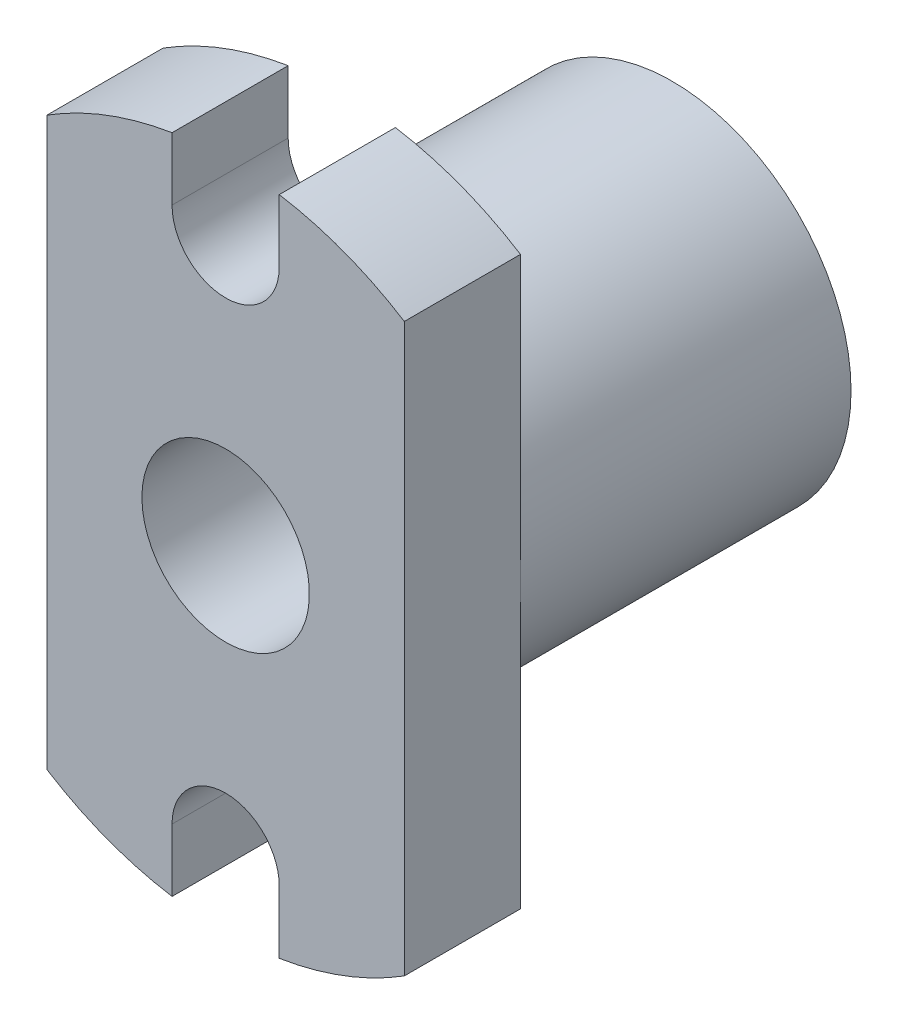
ISO-10303-21;
HEADER;
FILE_DESCRIPTION(('STEP AP214'),'2;1');
FILE_NAME('part.step','',(''),(''),'','','');
FILE_SCHEMA(('AUTOMOTIVE_DESIGN { 1 0 10303 214 1 1 1 1 }'));
ENDSEC;
DATA;
#1=APPLICATION_CONTEXT('core data for automotive mechanical design processes');
#2=APPLICATION_PROTOCOL_DEFINITION('international standard','automotive_design',2000,#1);
#3=PRODUCT_CONTEXT('',#1,'mechanical');
#4=PRODUCT('Part','Part','',(#3));
#5=PRODUCT_RELATED_PRODUCT_CATEGORY('part','',(#4));
#6=PRODUCT_DEFINITION_FORMATION('','',#4);
#7=PRODUCT_DEFINITION_CONTEXT('part definition',#1,'design');
#8=PRODUCT_DEFINITION('design','',#6,#7);
#9=PRODUCT_DEFINITION_SHAPE('','',#8);
#10=(LENGTH_UNIT() NAMED_UNIT(*) SI_UNIT(.MILLI.,.METRE.));
#11=(NAMED_UNIT(*) PLANE_ANGLE_UNIT() SI_UNIT($,.RADIAN.));
#12=(NAMED_UNIT(*) SI_UNIT($,.STERADIAN.) SOLID_ANGLE_UNIT());
#13=UNCERTAINTY_MEASURE_WITH_UNIT(LENGTH_MEASURE(1.E-05),#10,'distance_accuracy_value','');
#14=(GEOMETRIC_REPRESENTATION_CONTEXT(3) GLOBAL_UNCERTAINTY_ASSIGNED_CONTEXT((#13)) GLOBAL_UNIT_ASSIGNED_CONTEXT((#10,
#11,#12)) REPRESENTATION_CONTEXT('',''));
#15=CARTESIAN_POINT('',(0.,0.,0.));
#16=DIRECTION('',(0.,0.,1.));
#17=DIRECTION('',(1.,0.,0.));
#18=AXIS2_PLACEMENT_3D('',#15,#16,#17);
#19=CARTESIAN_POINT('',(0.,0.,12.7));
#20=DIRECTION('',(0.,0.,-1.));
#21=DIRECTION('',(-1.,0.,0.));
#22=AXIS2_PLACEMENT_3D('',#19,#20,#21);
#23=PLANE('',#22);
#24=CARTESIAN_POINT('',(0.,0.,12.7));
#25=DIRECTION('',(0.,0.,-1.));
#26=DIRECTION('',(-1.,0.,0.));
#27=AXIS2_PLACEMENT_3D('',#24,#25,#26);
#28=CIRCLE('',#27,2.38125);
#29=CARTESIAN_POINT('',(-2.38125,0.,12.7));
#30=VERTEX_POINT('',#29);
#31=EDGE_CURVE('E118',#30,#30,#28,.T.);
#32=ORIENTED_EDGE('',*,*,#31,.T.);
#33=EDGE_LOOP('',(#32));
#34=FACE_BOUND('',#33,.T.);
#35=CARTESIAN_POINT('',(0.,0.,12.7));
#36=DIRECTION('',(0.,0.,-1.));
#37=DIRECTION('',(-1.,0.,0.));
#38=AXIS2_PLACEMENT_3D('',#35,#36,#37);
#39=CIRCLE('',#38,9.52499999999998);
#40=CARTESIAN_POINT('',(1.524,9.40228956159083,12.7));
#41=VERTEX_POINT('',#40);
#42=CARTESIAN_POINT('',(5.08,8.05724673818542,12.7));
#43=VERTEX_POINT('',#42);
#44=EDGE_CURVE('E168',#41,#43,#39,.T.);
#45=ORIENTED_EDGE('',*,*,#44,.F.);
#46=DIRECTION('',(0.,1.,0.));
#47=VECTOR('',#46,1.);
#48=CARTESIAN_POINT('',(1.524,9.40228956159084,12.7));
#49=LINE('',#48,#47);
#50=CARTESIAN_POINT('',(1.524,7.62,12.7));
#51=VERTEX_POINT('',#50);
#52=EDGE_CURVE('E190',#51,#41,#49,.T.);
#53=ORIENTED_EDGE('',*,*,#52,.F.);
#54=CARTESIAN_POINT('',(0.,7.62,12.7));
#55=DIRECTION('',(0.,0.,-1.));
#56=DIRECTION('',(-1.,0.,0.));
#57=AXIS2_PLACEMENT_3D('',#54,#55,#56);
#58=CIRCLE('',#57,1.524);
#59=CARTESIAN_POINT('',(-1.524,7.62,12.7));
#60=VERTEX_POINT('',#59);
#61=EDGE_CURVE('E164',#51,#60,#58,.T.);
#62=ORIENTED_EDGE('',*,*,#61,.T.);
#63=DIRECTION('',(0.,1.,0.));
#64=VECTOR('',#63,1.);
#65=CARTESIAN_POINT('',(-1.524,7.62,12.7));
#66=LINE('',#65,#64);
#67=CARTESIAN_POINT('',(-1.524,9.40228956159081,12.7));
#68=VERTEX_POINT('',#67);
#69=EDGE_CURVE('E166',#68,#60,#66,.F.);
#70=ORIENTED_EDGE('',*,*,#69,.F.);
#71=CARTESIAN_POINT('',(0.,0.,12.7));
#72=DIRECTION('',(0.,0.,-1.));
#73=DIRECTION('',(-1.,0.,0.));
#74=AXIS2_PLACEMENT_3D('',#71,#72,#73);
#75=CIRCLE('',#74,9.52499999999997);
#76=CARTESIAN_POINT('',(-5.08,8.05724673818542,12.7));
#77=VERTEX_POINT('',#76);
#78=EDGE_CURVE('E159',#77,#68,#75,.T.);
#79=ORIENTED_EDGE('',*,*,#78,.F.);
#80=DIRECTION('',(0.,1.,0.));
#81=VECTOR('',#80,1.);
#82=CARTESIAN_POINT('',(-5.08,8.05724673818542,12.7));
#83=LINE('',#82,#81);
#84=CARTESIAN_POINT('',(-5.08,-8.05724673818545,12.7));
#85=VERTEX_POINT('',#84);
#86=EDGE_CURVE('E115',#85,#77,#83,.T.);
#87=ORIENTED_EDGE('',*,*,#86,.F.);
#88=CARTESIAN_POINT('',(0.,0.,12.7));
#89=DIRECTION('',(0.,0.,-1.));
#90=DIRECTION('',(-1.,0.,0.));
#91=AXIS2_PLACEMENT_3D('',#88,#89,#90);
#92=CIRCLE('',#91,9.525);
#93=CARTESIAN_POINT('',(-1.52399999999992,-9.40228956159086,12.7));
#94=VERTEX_POINT('',#93);
#95=EDGE_CURVE('E20',#94,#85,#92,.T.);
#96=ORIENTED_EDGE('',*,*,#95,.F.);
#97=DIRECTION('',(0.,1.,0.));
#98=VECTOR('',#97,1.);
#99=CARTESIAN_POINT('',(-1.52399999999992,-9.40228956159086,12.7));
#100=LINE('',#99,#98);
#101=CARTESIAN_POINT('',(-1.52399999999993,-7.62,12.7));
#102=VERTEX_POINT('',#101);
#103=EDGE_CURVE('E112',#102,#94,#100,.F.);
#104=ORIENTED_EDGE('',*,*,#103,.F.);
#105=CARTESIAN_POINT('',(0.,-7.62,12.7));
#106=DIRECTION('',(0.,0.,-1.));
#107=DIRECTION('',(-1.,0.,0.));
#108=AXIS2_PLACEMENT_3D('',#105,#106,#107);
#109=CIRCLE('',#108,1.524);
#110=CARTESIAN_POINT('',(1.52400000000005,-7.61999999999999,12.7));
#111=VERTEX_POINT('',#110);
#112=EDGE_CURVE('E177',#102,#111,#109,.T.);
#113=ORIENTED_EDGE('',*,*,#112,.T.);
#114=DIRECTION('',(0.,1.,0.));
#115=VECTOR('',#114,1.);
#116=CARTESIAN_POINT('',(1.52400000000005,-7.61999999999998,12.7));
#117=LINE('',#116,#115);
#118=CARTESIAN_POINT('',(1.52400000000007,-9.40228956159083,12.7));
#119=VERTEX_POINT('',#118);
#120=EDGE_CURVE('E133',#119,#111,#117,.T.);
#121=ORIENTED_EDGE('',*,*,#120,.F.);
#122=CARTESIAN_POINT('',(0.,0.,12.7));
#123=DIRECTION('',(0.,0.,-1.));
#124=DIRECTION('',(-1.,0.,0.));
#125=AXIS2_PLACEMENT_3D('',#122,#123,#124);
#126=CIRCLE('',#125,9.525);
#127=CARTESIAN_POINT('',(5.08,-8.05724673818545,12.7));
#128=VERTEX_POINT('',#127);
#129=EDGE_CURVE('E173',#128,#119,#126,.T.);
#130=ORIENTED_EDGE('',*,*,#129,.F.);
#131=DIRECTION('',(0.,1.,0.));
#132=VECTOR('',#131,1.);
#133=CARTESIAN_POINT('',(5.08,-8.05724673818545,12.7));
#134=LINE('',#133,#132);
#135=EDGE_CURVE('E193',#43,#128,#134,.F.);
#136=ORIENTED_EDGE('',*,*,#135,.F.);
#137=EDGE_LOOP('',(#45,#53,#62,#70,#79,#87,#96,#104,#113,#121,#130,#136));
#138=FACE_BOUND('',#137,.T.);
#139=ADVANCED_FACE('F16',(#34,#138),#23,.F.);
#140=CARTESIAN_POINT('',(0.,0.,12.7));
#141=DIRECTION('',(0.,0.,-1.));
#142=DIRECTION('',(-1.,0.,0.));
#143=AXIS2_PLACEMENT_3D('',#140,#141,#142);
#144=CYLINDRICAL_SURFACE('',#143,9.525);
#145=ORIENTED_EDGE('',*,*,#95,.T.);
#146=DIRECTION('',(0.,0.,1.));
#147=VECTOR('',#146,1.);
#148=CARTESIAN_POINT('',(-5.08,-8.05724673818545,12.7));
#149=LINE('',#148,#147);
#150=CARTESIAN_POINT('',(-5.08,-8.05724673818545,9.398));
#151=VERTEX_POINT('',#150);
#152=EDGE_CURVE('E184',#151,#85,#149,.T.);
#153=ORIENTED_EDGE('',*,*,#152,.F.);
#154=CARTESIAN_POINT('',(0.,0.,9.398));
#155=DIRECTION('',(0.,0.,-1.));
#156=DIRECTION('',(-1.,0.,0.));
#157=AXIS2_PLACEMENT_3D('',#154,#155,#156);
#158=CIRCLE('',#157,9.525);
#159=CARTESIAN_POINT('',(-1.52399999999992,-9.40228956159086,9.398));
#160=VERTEX_POINT('',#159);
#161=EDGE_CURVE('E123',#151,#160,#158,.F.);
#162=ORIENTED_EDGE('',*,*,#161,.T.);
#163=DIRECTION('',(0.,0.,-1.));
#164=VECTOR('',#163,1.);
#165=CARTESIAN_POINT('',(-1.52399999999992,-9.40228956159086,12.7));
#166=LINE('',#165,#164);
#167=EDGE_CURVE('E120',#94,#160,#166,.T.);
#168=ORIENTED_EDGE('',*,*,#167,.F.);
#169=EDGE_LOOP('',(#145,#153,#162,#168));
#170=FACE_BOUND('',#169,.T.);
#171=ADVANCED_FACE('F121',(#170),#144,.T.);
#172=CARTESIAN_POINT('',(-1.52399999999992,-9.40228956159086,12.7));
#173=DIRECTION('',(1.,0.,0.));
#174=DIRECTION('',(0.,0.,-1.));
#175=AXIS2_PLACEMENT_3D('',#172,#173,#174);
#176=PLANE('',#175);
#177=ORIENTED_EDGE('',*,*,#103,.T.);
#178=ORIENTED_EDGE('',*,*,#167,.T.);
#179=DIRECTION('',(0.,1.,0.));
#180=VECTOR('',#179,1.);
#181=CARTESIAN_POINT('',(-1.52399999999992,0.,9.398));
#182=LINE('',#181,#180);
#183=CARTESIAN_POINT('',(-1.52399999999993,-7.62,9.398));
#184=VERTEX_POINT('',#183);
#185=EDGE_CURVE('E156',#160,#184,#182,.T.);
#186=ORIENTED_EDGE('',*,*,#185,.T.);
#187=DIRECTION('',(0.,0.,-1.));
#188=VECTOR('',#187,1.);
#189=CARTESIAN_POINT('',(-1.52399999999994,-7.62,12.7));
#190=LINE('',#189,#188);
#191=EDGE_CURVE('E126',#184,#102,#190,.F.);
#192=ORIENTED_EDGE('',*,*,#191,.T.);
#193=EDGE_LOOP('',(#177,#178,#186,#192));
#194=FACE_BOUND('',#193,.T.);
#195=ADVANCED_FACE('F128',(#194),#176,.T.);
#196=CARTESIAN_POINT('',(0.,-7.62,12.7));
#197=DIRECTION('',(0.,0.,-1.));
#198=DIRECTION('',(-1.,0.,0.));
#199=AXIS2_PLACEMENT_3D('',#196,#197,#198);
#200=CYLINDRICAL_SURFACE('',#199,1.524);
#201=DIRECTION('',(0.,0.,1.));
#202=VECTOR('',#201,1.);
#203=CARTESIAN_POINT('',(1.52400000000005,-7.61999999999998,12.7));
#204=LINE('',#203,#202);
#205=CARTESIAN_POINT('',(1.52400000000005,-7.61999999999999,9.398));
#206=VERTEX_POINT('',#205);
#207=EDGE_CURVE('E176',#111,#206,#204,.F.);
#208=ORIENTED_EDGE('',*,*,#207,.F.);
#209=ORIENTED_EDGE('',*,*,#112,.F.);
#210=ORIENTED_EDGE('',*,*,#191,.F.);
#211=CARTESIAN_POINT('',(0.,-7.62,9.398));
#212=DIRECTION('',(0.,0.,-1.));
#213=DIRECTION('',(-1.,0.,0.));
#214=AXIS2_PLACEMENT_3D('',#211,#212,#213);
#215=CIRCLE('',#214,1.524);
#216=EDGE_CURVE('E154',#184,#206,#215,.T.);
#217=ORIENTED_EDGE('',*,*,#216,.T.);
#218=EDGE_LOOP('',(#208,#209,#210,#217));
#219=FACE_BOUND('',#218,.T.);
#220=ADVANCED_FACE('F265',(#219),#200,.F.);
#221=CARTESIAN_POINT('',(1.52400000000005,-7.61999999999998,12.7));
#222=DIRECTION('',(-1.,0.,0.));
#223=DIRECTION('',(0.,0.,1.));
#224=AXIS2_PLACEMENT_3D('',#221,#222,#223);
#225=PLANE('',#224);
#226=ORIENTED_EDGE('',*,*,#120,.T.);
#227=ORIENTED_EDGE('',*,*,#207,.T.);
#228=DIRECTION('',(0.,1.,0.));
#229=VECTOR('',#228,1.);
#230=CARTESIAN_POINT('',(1.52400000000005,0.,9.398));
#231=LINE('',#230,#229);
#232=CARTESIAN_POINT('',(1.52400000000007,-9.40228956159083,9.398));
#233=VERTEX_POINT('',#232);
#234=EDGE_CURVE('E153',#206,#233,#231,.F.);
#235=ORIENTED_EDGE('',*,*,#234,.T.);
#236=DIRECTION('',(0.,0.,-1.));
#237=VECTOR('',#236,1.);
#238=CARTESIAN_POINT('',(1.52400000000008,-9.40228956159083,12.7));
#239=LINE('',#238,#237);
#240=EDGE_CURVE('E175',#119,#233,#239,.T.);
#241=ORIENTED_EDGE('',*,*,#240,.F.);
#242=EDGE_LOOP('',(#226,#227,#235,#241));
#243=FACE_BOUND('',#242,.T.);
#244=ADVANCED_FACE('F263',(#243),#225,.T.);
#245=CARTESIAN_POINT('',(0.,0.,12.7));
#246=DIRECTION('',(0.,0.,-1.));
#247=DIRECTION('',(-1.,0.,0.));
#248=AXIS2_PLACEMENT_3D('',#245,#246,#247);
#249=CYLINDRICAL_SURFACE('',#248,9.525);
#250=ORIENTED_EDGE('',*,*,#129,.T.);
#251=ORIENTED_EDGE('',*,*,#240,.T.);
#252=CARTESIAN_POINT('',(0.,0.,9.398));
#253=DIRECTION('',(0.,0.,-1.));
#254=DIRECTION('',(-1.,0.,0.));
#255=AXIS2_PLACEMENT_3D('',#252,#253,#254);
#256=CIRCLE('',#255,9.525);
#257=CARTESIAN_POINT('',(5.08,-8.05724673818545,9.398));
#258=VERTEX_POINT('',#257);
#259=EDGE_CURVE('E150',#233,#258,#256,.F.);
#260=ORIENTED_EDGE('',*,*,#259,.T.);
#261=DIRECTION('',(0.,0.,-1.));
#262=VECTOR('',#261,1.);
#263=CARTESIAN_POINT('',(5.08,-8.05724673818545,12.7));
#264=LINE('',#263,#262);
#265=EDGE_CURVE('E172',#128,#258,#264,.T.);
#266=ORIENTED_EDGE('',*,*,#265,.F.);
#267=EDGE_LOOP('',(#250,#251,#260,#266));
#268=FACE_BOUND('',#267,.T.);
#269=ADVANCED_FACE('F258',(#268),#249,.T.);
#270=CARTESIAN_POINT('',(5.08,-8.05724673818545,12.7));
#271=DIRECTION('',(1.,0.,0.));
#272=DIRECTION('',(0.,0.,-1.));
#273=AXIS2_PLACEMENT_3D('',#270,#271,#272);
#274=PLANE('',#273);
#275=ORIENTED_EDGE('',*,*,#265,.T.);
#276=DIRECTION('',(0.,1.,0.));
#277=VECTOR('',#276,1.);
#278=CARTESIAN_POINT('',(5.08,0.,9.398));
#279=LINE('',#278,#277);
#280=CARTESIAN_POINT('',(5.08,0.,9.398));
#281=VERTEX_POINT('',#280);
#282=EDGE_CURVE('E152',#258,#281,#279,.T.);
#283=ORIENTED_EDGE('',*,*,#282,.T.);
#284=DIRECTION('',(0.,1.,0.));
#285=VECTOR('',#284,1.);
#286=CARTESIAN_POINT('',(5.08,0.,9.398));
#287=LINE('',#286,#285);
#288=CARTESIAN_POINT('',(5.08,8.05724673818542,9.398));
#289=VERTEX_POINT('',#288);
#290=EDGE_CURVE('E149',#281,#289,#287,.T.);
#291=ORIENTED_EDGE('',*,*,#290,.T.);
#292=DIRECTION('',(0.,0.,-1.));
#293=VECTOR('',#292,1.);
#294=CARTESIAN_POINT('',(5.08,8.05724673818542,12.7));
#295=LINE('',#294,#293);
#296=EDGE_CURVE('E171',#43,#289,#295,.T.);
#297=ORIENTED_EDGE('',*,*,#296,.F.);
#298=ORIENTED_EDGE('',*,*,#135,.T.);
#299=EDGE_LOOP('',(#275,#283,#291,#297,#298));
#300=FACE_BOUND('',#299,.T.);
#301=ADVANCED_FACE('F253',(#300),#274,.T.);
#302=CARTESIAN_POINT('',(0.,0.,12.7));
#303=DIRECTION('',(0.,0.,-1.));
#304=DIRECTION('',(-1.,0.,0.));
#305=AXIS2_PLACEMENT_3D('',#302,#303,#304);
#306=CYLINDRICAL_SURFACE('',#305,9.52499999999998);
#307=ORIENTED_EDGE('',*,*,#44,.T.);
#308=ORIENTED_EDGE('',*,*,#296,.T.);
#309=CARTESIAN_POINT('',(0.,0.,9.398));
#310=DIRECTION('',(0.,0.,-1.));
#311=DIRECTION('',(-1.,0.,0.));
#312=AXIS2_PLACEMENT_3D('',#309,#310,#311);
#313=CIRCLE('',#312,9.52499999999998);
#314=CARTESIAN_POINT('',(1.524,9.40228956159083,9.398));
#315=VERTEX_POINT('',#314);
#316=EDGE_CURVE('E147',#289,#315,#313,.F.);
#317=ORIENTED_EDGE('',*,*,#316,.T.);
#318=DIRECTION('',(0.,0.,1.));
#319=VECTOR('',#318,1.);
#320=CARTESIAN_POINT('',(1.524,9.40228956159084,12.7));
#321=LINE('',#320,#319);
#322=EDGE_CURVE('E192',#41,#315,#321,.F.);
#323=ORIENTED_EDGE('',*,*,#322,.F.);
#324=EDGE_LOOP('',(#307,#308,#317,#323));
#325=FACE_BOUND('',#324,.T.);
#326=ADVANCED_FACE('F255',(#325),#306,.T.);
#327=CARTESIAN_POINT('',(1.524,9.40228956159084,12.7));
#328=DIRECTION('',(-1.,0.,0.));
#329=DIRECTION('',(0.,0.,1.));
#330=AXIS2_PLACEMENT_3D('',#327,#328,#329);
#331=PLANE('',#330);
#332=ORIENTED_EDGE('',*,*,#52,.T.);
#333=ORIENTED_EDGE('',*,*,#322,.T.);
#334=DIRECTION('',(0.,1.,0.));
#335=VECTOR('',#334,1.);
#336=CARTESIAN_POINT('',(1.524,0.,9.398));
#337=LINE('',#336,#335);
#338=CARTESIAN_POINT('',(1.524,7.62,9.398));
#339=VERTEX_POINT('',#338);
#340=EDGE_CURVE('E146',#315,#339,#337,.F.);
#341=ORIENTED_EDGE('',*,*,#340,.T.);
#342=DIRECTION('',(0.,0.,-1.));
#343=VECTOR('',#342,1.);
#344=CARTESIAN_POINT('',(1.524,7.62,12.7));
#345=LINE('',#344,#343);
#346=EDGE_CURVE('E167',#339,#51,#345,.F.);
#347=ORIENTED_EDGE('',*,*,#346,.T.);
#348=EDGE_LOOP('',(#332,#333,#341,#347));
#349=FACE_BOUND('',#348,.T.);
#350=ADVANCED_FACE('F283',(#349),#331,.T.);
#351=CARTESIAN_POINT('',(0.,7.62,12.7));
#352=DIRECTION('',(0.,0.,-1.));
#353=DIRECTION('',(-1.,0.,0.));
#354=AXIS2_PLACEMENT_3D('',#351,#352,#353);
#355=CYLINDRICAL_SURFACE('',#354,1.524);
#356=DIRECTION('',(0.,0.,-1.));
#357=VECTOR('',#356,1.);
#358=CARTESIAN_POINT('',(-1.524,7.62,12.7));
#359=LINE('',#358,#357);
#360=CARTESIAN_POINT('',(-1.524,7.62,9.398));
#361=VERTEX_POINT('',#360);
#362=EDGE_CURVE('E163',#60,#361,#359,.T.);
#363=ORIENTED_EDGE('',*,*,#362,.F.);
#364=ORIENTED_EDGE('',*,*,#61,.F.);
#365=ORIENTED_EDGE('',*,*,#346,.F.);
#366=CARTESIAN_POINT('',(0.,7.62,9.398));
#367=DIRECTION('',(0.,0.,-1.));
#368=DIRECTION('',(-1.,0.,0.));
#369=AXIS2_PLACEMENT_3D('',#366,#367,#368);
#370=CIRCLE('',#369,1.524);
#371=EDGE_CURVE('E144',#339,#361,#370,.T.);
#372=ORIENTED_EDGE('',*,*,#371,.T.);
#373=EDGE_LOOP('',(#363,#364,#365,#372));
#374=FACE_BOUND('',#373,.T.);
#375=ADVANCED_FACE('F286',(#374),#355,.F.);
#376=CARTESIAN_POINT('',(-1.524,7.62,12.7));
#377=DIRECTION('',(1.,0.,0.));
#378=DIRECTION('',(0.,0.,-1.));
#379=AXIS2_PLACEMENT_3D('',#376,#377,#378);
#380=PLANE('',#379);
#381=ORIENTED_EDGE('',*,*,#69,.T.);
#382=ORIENTED_EDGE('',*,*,#362,.T.);
#383=DIRECTION('',(0.,1.,0.));
#384=VECTOR('',#383,1.);
#385=CARTESIAN_POINT('',(-1.524,0.,9.398));
#386=LINE('',#385,#384);
#387=CARTESIAN_POINT('',(-1.524,9.40228956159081,9.398));
#388=VERTEX_POINT('',#387);
#389=EDGE_CURVE('E143',#361,#388,#386,.T.);
#390=ORIENTED_EDGE('',*,*,#389,.T.);
#391=DIRECTION('',(0.,0.,-1.));
#392=VECTOR('',#391,1.);
#393=CARTESIAN_POINT('',(-1.524,9.40228956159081,12.7));
#394=LINE('',#393,#392);
#395=EDGE_CURVE('E162',#68,#388,#394,.T.);
#396=ORIENTED_EDGE('',*,*,#395,.F.);
#397=EDGE_LOOP('',(#381,#382,#390,#396));
#398=FACE_BOUND('',#397,.T.);
#399=ADVANCED_FACE('F290',(#398),#380,.T.);
#400=CARTESIAN_POINT('',(0.,0.,12.7));
#401=DIRECTION('',(0.,0.,-1.));
#402=DIRECTION('',(-1.,0.,0.));
#403=AXIS2_PLACEMENT_3D('',#400,#401,#402);
#404=CYLINDRICAL_SURFACE('',#403,9.52499999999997);
#405=ORIENTED_EDGE('',*,*,#78,.T.);
#406=ORIENTED_EDGE('',*,*,#395,.T.);
#407=CARTESIAN_POINT('',(0.,0.,9.398));
#408=DIRECTION('',(0.,0.,-1.));
#409=DIRECTION('',(-1.,0.,0.));
#410=AXIS2_PLACEMENT_3D('',#407,#408,#409);
#411=CIRCLE('',#410,9.52499999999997);
#412=CARTESIAN_POINT('',(-5.08,8.05724673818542,9.398));
#413=VERTEX_POINT('',#412);
#414=EDGE_CURVE('E141',#388,#413,#411,.F.);
#415=ORIENTED_EDGE('',*,*,#414,.T.);
#416=DIRECTION('',(0.,0.,1.));
#417=VECTOR('',#416,1.);
#418=CARTESIAN_POINT('',(-5.08,8.05724673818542,12.7));
#419=LINE('',#418,#417);
#420=EDGE_CURVE('E187',#77,#413,#419,.F.);
#421=ORIENTED_EDGE('',*,*,#420,.F.);
#422=EDGE_LOOP('',(#405,#406,#415,#421));
#423=FACE_BOUND('',#422,.T.);
#424=ADVANCED_FACE('F294',(#423),#404,.T.);
#425=CARTESIAN_POINT('',(-5.08,8.05724673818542,12.7));
#426=DIRECTION('',(-1.,0.,0.));
#427=DIRECTION('',(0.,0.,1.));
#428=AXIS2_PLACEMENT_3D('',#425,#426,#427);
#429=PLANE('',#428);
#430=ORIENTED_EDGE('',*,*,#420,.T.);
#431=DIRECTION('',(0.,1.,0.));
#432=VECTOR('',#431,1.);
#433=CARTESIAN_POINT('',(-5.08,0.,9.398));
#434=LINE('',#433,#432);
#435=CARTESIAN_POINT('',(-5.08,0.,9.398));
#436=VERTEX_POINT('',#435);
#437=EDGE_CURVE('E35',#413,#436,#434,.F.);
#438=ORIENTED_EDGE('',*,*,#437,.T.);
#439=DIRECTION('',(0.,1.,0.));
#440=VECTOR('',#439,1.);
#441=CARTESIAN_POINT('',(-5.08,0.,9.398));
#442=LINE('',#441,#440);
#443=EDGE_CURVE('E158',#436,#151,#442,.F.);
#444=ORIENTED_EDGE('',*,*,#443,.T.);
#445=ORIENTED_EDGE('',*,*,#152,.T.);
#446=ORIENTED_EDGE('',*,*,#86,.T.);
#447=EDGE_LOOP('',(#430,#438,#444,#445,#446));
#448=FACE_BOUND('',#447,.T.);
#449=ADVANCED_FACE('F298',(#448),#429,.T.);
#450=CARTESIAN_POINT('',(0.,0.,9.398));
#451=DIRECTION('',(0.,0.,1.));
#452=DIRECTION('',(1.,0.,0.));
#453=AXIS2_PLACEMENT_3D('',#450,#451,#452);
#454=PLANE('',#453);
#455=ORIENTED_EDGE('',*,*,#282,.F.);
#456=ORIENTED_EDGE('',*,*,#259,.F.);
#457=ORIENTED_EDGE('',*,*,#234,.F.);
#458=ORIENTED_EDGE('',*,*,#216,.F.);
#459=ORIENTED_EDGE('',*,*,#185,.F.);
#460=ORIENTED_EDGE('',*,*,#161,.F.);
#461=ORIENTED_EDGE('',*,*,#443,.F.);
#462=CARTESIAN_POINT('',(0.,0.,9.398));
#463=DIRECTION('',(0.,0.,1.));
#464=DIRECTION('',(1.,0.,0.));
#465=AXIS2_PLACEMENT_3D('',#462,#463,#464);
#466=CIRCLE('',#465,5.08);
#467=EDGE_CURVE('E138',#281,#436,#466,.F.);
#468=ORIENTED_EDGE('',*,*,#467,.F.);
#469=EDGE_LOOP('',(#455,#456,#457,#458,#459,#460,#461,#468));
#470=FACE_BOUND('',#469,.T.);
#471=ADVANCED_FACE('F249',(#470),#454,.F.);
#472=CARTESIAN_POINT('',(0.,0.,9.398));
#473=DIRECTION('',(0.,0.,1.));
#474=DIRECTION('',(1.,0.,0.));
#475=AXIS2_PLACEMENT_3D('',#472,#473,#474);
#476=PLANE('',#475);
#477=ORIENTED_EDGE('',*,*,#437,.F.);
#478=ORIENTED_EDGE('',*,*,#414,.F.);
#479=ORIENTED_EDGE('',*,*,#389,.F.);
#480=ORIENTED_EDGE('',*,*,#371,.F.);
#481=ORIENTED_EDGE('',*,*,#340,.F.);
#482=ORIENTED_EDGE('',*,*,#316,.F.);
#483=ORIENTED_EDGE('',*,*,#290,.F.);
#484=CARTESIAN_POINT('',(0.,0.,9.398));
#485=DIRECTION('',(0.,0.,1.));
#486=DIRECTION('',(1.,0.,0.));
#487=AXIS2_PLACEMENT_3D('',#484,#485,#486);
#488=CIRCLE('',#487,5.08);
#489=EDGE_CURVE('E26',#436,#281,#488,.F.);
#490=ORIENTED_EDGE('',*,*,#489,.F.);
#491=EDGE_LOOP('',(#477,#478,#479,#480,#481,#482,#483,#490));
#492=FACE_BOUND('',#491,.T.);
#493=ADVANCED_FACE('F239',(#492),#476,.F.);
#494=CARTESIAN_POINT('',(0.,0.,0.));
#495=DIRECTION('',(0.,0.,-1.));
#496=DIRECTION('',(-1.,0.,0.));
#497=AXIS2_PLACEMENT_3D('',#494,#495,#496);
#498=PLANE('',#497);
#499=CARTESIAN_POINT('',(0.,0.,0.));
#500=DIRECTION('',(0.,0.,-1.));
#501=DIRECTION('',(-1.,0.,0.));
#502=AXIS2_PLACEMENT_3D('',#499,#500,#501);
#503=CIRCLE('',#502,2.38125);
#504=CARTESIAN_POINT('',(-2.38125,0.,0.));
#505=VERTEX_POINT('',#504);
#506=EDGE_CURVE('E223',#505,#505,#503,.T.);
#507=ORIENTED_EDGE('',*,*,#506,.F.);
#508=EDGE_LOOP('',(#507));
#509=FACE_BOUND('',#508,.T.);
#510=CARTESIAN_POINT('',(0.,0.,0.));
#511=DIRECTION('',(0.,0.,1.));
#512=DIRECTION('',(1.,0.,0.));
#513=AXIS2_PLACEMENT_3D('',#510,#511,#512);
#514=CIRCLE('',#513,5.08);
#515=CARTESIAN_POINT('',(5.08,0.,0.));
#516=VERTEX_POINT('',#515);
#517=EDGE_CURVE('E10',#516,#516,#514,.T.);
#518=ORIENTED_EDGE('',*,*,#517,.F.);
#519=EDGE_LOOP('',(#518));
#520=FACE_BOUND('',#519,.T.);
#521=ADVANCED_FACE('F236',(#509,#520),#498,.T.);
#522=CARTESIAN_POINT('',(0.,0.,0.));
#523=DIRECTION('',(0.,0.,1.));
#524=DIRECTION('',(1.,0.,0.));
#525=AXIS2_PLACEMENT_3D('',#522,#523,#524);
#526=CYLINDRICAL_SURFACE('',#525,5.08);
#527=ORIENTED_EDGE('',*,*,#517,.T.);
#528=EDGE_LOOP('',(#527));
#529=FACE_BOUND('',#528,.T.);
#530=ORIENTED_EDGE('',*,*,#467,.T.);
#531=ORIENTED_EDGE('',*,*,#489,.T.);
#532=EDGE_LOOP('',(#530,#531));
#533=FACE_BOUND('',#532,.T.);
#534=ADVANCED_FACE('F18',(#529,#533),#526,.T.);
#535=CARTESIAN_POINT('',(0.,0.,12.7));
#536=DIRECTION('',(0.,0.,-1.));
#537=DIRECTION('',(-1.,0.,0.));
#538=AXIS2_PLACEMENT_3D('',#535,#536,#537);
#539=CYLINDRICAL_SURFACE('',#538,2.38125);
#540=CARTESIAN_POINT('',(-2.38125,0.,12.7));
#541=CARTESIAN_POINT('',(-2.38125,0.,12.5677083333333));
#542=CARTESIAN_POINT('',(-2.38125,0.,12.4354166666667));
#543=CARTESIAN_POINT('',(-2.38125,0.,12.1708333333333));
#544=CARTESIAN_POINT('',(-2.38125,0.,12.0385416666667));
#545=CARTESIAN_POINT('',(-2.38125,0.,11.7739583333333));
#546=CARTESIAN_POINT('',(-2.38125,0.,11.6416666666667));
#547=CARTESIAN_POINT('',(-2.38125,0.,11.3770833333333));
#548=CARTESIAN_POINT('',(-2.38125,0.,11.2447916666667));
#549=CARTESIAN_POINT('',(-2.38125,0.,10.9802083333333));
#550=CARTESIAN_POINT('',(-2.38125,0.,10.8479166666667));
#551=CARTESIAN_POINT('',(-2.38125,0.,10.5833333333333));
#552=CARTESIAN_POINT('',(-2.38125,0.,10.4510416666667));
#553=CARTESIAN_POINT('',(-2.38125,0.,10.1864583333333));
#554=CARTESIAN_POINT('',(-2.38125,0.,10.0541666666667));
#555=CARTESIAN_POINT('',(-2.38125,0.,9.78958333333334));
#556=CARTESIAN_POINT('',(-2.38125,0.,9.65729166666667));
#557=CARTESIAN_POINT('',(-2.38125,0.,9.39270833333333));
#558=CARTESIAN_POINT('',(-2.38125,0.,9.26041666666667));
#559=CARTESIAN_POINT('',(-2.38125,0.,8.99583333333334));
#560=CARTESIAN_POINT('',(-2.38125,0.,8.86354166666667));
#561=CARTESIAN_POINT('',(-2.38125,0.,8.59895833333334));
#562=CARTESIAN_POINT('',(-2.38125,0.,8.46666666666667));
#563=CARTESIAN_POINT('',(-2.38125,0.,8.20208333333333));
#564=CARTESIAN_POINT('',(-2.38125,0.,8.06979166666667));
#565=CARTESIAN_POINT('',(-2.38125,0.,7.80520833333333));
#566=CARTESIAN_POINT('',(-2.38125,0.,7.67291666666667));
#567=CARTESIAN_POINT('',(-2.38125,0.,7.40833333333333));
#568=CARTESIAN_POINT('',(-2.38125,0.,7.27604166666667));
#569=CARTESIAN_POINT('',(-2.38125,0.,7.01145833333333));
#570=CARTESIAN_POINT('',(-2.38125,0.,6.87916666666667));
#571=CARTESIAN_POINT('',(-2.38125,0.,6.61458333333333));
#572=CARTESIAN_POINT('',(-2.38125,0.,6.48229166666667));
#573=CARTESIAN_POINT('',(-2.38125,0.,6.21770833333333));
#574=CARTESIAN_POINT('',(-2.38125,0.,6.08541666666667));
#575=CARTESIAN_POINT('',(-2.38125,0.,5.82083333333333));
#576=CARTESIAN_POINT('',(-2.38125,0.,5.68854166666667));
#577=CARTESIAN_POINT('',(-2.38125,0.,5.42395833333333));
#578=CARTESIAN_POINT('',(-2.38125,0.,5.29166666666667));
#579=CARTESIAN_POINT('',(-2.38125,0.,5.02708333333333));
#580=CARTESIAN_POINT('',(-2.38125,0.,4.89479166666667));
#581=CARTESIAN_POINT('',(-2.38125,0.,4.63020833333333));
#582=CARTESIAN_POINT('',(-2.38125,0.,4.49791666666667));
#583=CARTESIAN_POINT('',(-2.38125,0.,4.23333333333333));
#584=CARTESIAN_POINT('',(-2.38125,0.,4.10104166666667));
#585=CARTESIAN_POINT('',(-2.38125,0.,3.83645833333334));
#586=CARTESIAN_POINT('',(-2.38125,0.,3.70416666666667));
#587=CARTESIAN_POINT('',(-2.38125,0.,3.43958333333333));
#588=CARTESIAN_POINT('',(-2.38125,0.,3.30729166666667));
#589=CARTESIAN_POINT('',(-2.38125,0.,3.04270833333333));
#590=CARTESIAN_POINT('',(-2.38125,0.,2.91041666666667));
#591=CARTESIAN_POINT('',(-2.38125,0.,2.64583333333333));
#592=CARTESIAN_POINT('',(-2.38125,0.,2.51354166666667));
#593=CARTESIAN_POINT('',(-2.38125,0.,2.24895833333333));
#594=CARTESIAN_POINT('',(-2.38125,0.,2.11666666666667));
#595=CARTESIAN_POINT('',(-2.38125,0.,1.85208333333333));
#596=CARTESIAN_POINT('',(-2.38125,0.,1.71979166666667));
#597=CARTESIAN_POINT('',(-2.38125,0.,1.45520833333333));
#598=CARTESIAN_POINT('',(-2.38125,0.,1.32291666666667));
#599=CARTESIAN_POINT('',(-2.38125,0.,1.05833333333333));
#600=CARTESIAN_POINT('',(-2.38125,0.,0.926041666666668));
#601=CARTESIAN_POINT('',(-2.38125,0.,0.661458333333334));
#602=CARTESIAN_POINT('',(-2.38125,0.,0.529166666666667));
#603=CARTESIAN_POINT('',(-2.38125,0.,0.264583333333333));
#604=CARTESIAN_POINT('',(-2.38125,0.,0.132291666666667));
#605=CARTESIAN_POINT('',(-2.38125,0.,0.));
#606=B_SPLINE_CURVE_WITH_KNOTS('',3,(#540,#541,#542,#543,#544,#545,#546,#547,#548,#549,#550,
#551,#552,#553,#554,#555,#556,#557,#558,#559,#560,#561,#562,#563,#564,#565,#566,#567,#568,#569,
#570,#571,#572,#573,#574,#575,#576,#577,#578,#579,#580,#581,#582,#583,#584,#585,#586,#587,#588,
#589,#590,#591,#592,#593,#594,#595,#596,#597,#598,#599,#600,#601,#602,#603,#604,#605),
.UNSPECIFIED.,.F.,.F.,(4,2,2,2,2,2,2,2,2,2,2,2,2,2,2,2,2,2,2,2,2,2,2,2,2,2,2,2,2,2,2,2,4),(0.,
0.396875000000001,0.793750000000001,1.190625,1.5875,1.984375,2.38125,2.778125,3.175,3.571875,
3.96875,4.365625,4.7625,5.159375,5.55625,5.953125,6.35,6.746875,7.14375,7.540625,7.9375,
8.334375,8.73125,9.128125,9.525,9.921875,10.31875,10.715625,11.1125,11.509375,11.90625,
12.303125,12.7),.UNSPECIFIED.);
#607=EDGE_CURVE('BSEAM230',#30,#505,#606,.T.);
#608=ORIENTED_EDGE('',*,*,#31,.F.);
#609=ORIENTED_EDGE('',*,*,#506,.T.);
#610=ORIENTED_EDGE('',*,*,#607,.T.);
#611=ORIENTED_EDGE('',*,*,#607,.F.);
#612=EDGE_LOOP('',(#608,#610,#609,#611));
#613=FACE_BOUND('',#612,.T.);
#614=ADVANCED_FACE('F230',(#613),#539,.F.);
#615=CLOSED_SHELL('',(#139,#171,#195,#220,#244,#269,#301,#326,#350,#375,#399,#424,#449,#471,
#493,#521,#534,#614));
#616=MANIFOLD_SOLID_BREP('B1',#615);
#617=ADVANCED_BREP_SHAPE_REPRESENTATION('',(#18,#616),#14);
#618=SHAPE_DEFINITION_REPRESENTATION(#9,#617);
ENDSEC;
END-ISO-10303-21;
